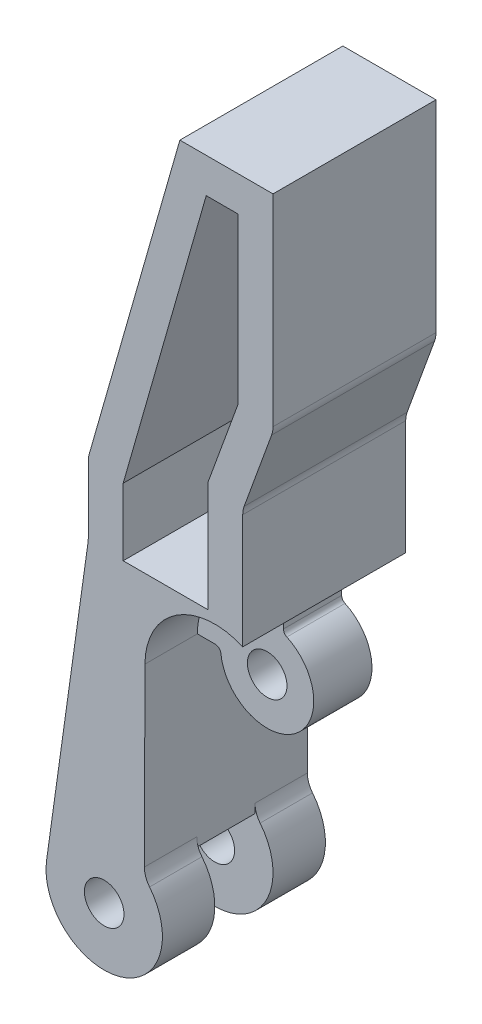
from build123d import *

# Parameters (mm, degrees)
BOSS_EXTRUDE1_DEPTH                                  = 7
CUT_EXTRUDE1_DEPTH                                   = 64.294944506
CUT_EXTRUDE1_DEPTH_BACK                              = 64.294944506
BOSS_EXTRUDE2_DEPTH                                  = 2.5
SKETCH4_R                                            = 5
CUT_EXTRUDE2_DEPTH                                   = 2.5
M3_CLEARANCE_HOLE1_D                                 = 3.4
CSK_FOR_M3_HEX_SOCKET_COUNTERSUNK_CAP_SC_D           = 3.4
CSK_FOR_M3_HEX_SOCKET_COUNTERSUNK_CAP_SC_DEPTH       = 14.000055
CSK_FOR_M3_HEX_SOCKET_COUNTERSUNK_CAP_SC_CSINK_D     = 6.72
CSK_FOR_M3_HEX_SOCKET_COUNTERSUNK_CAP_SC_CSINK_ANGLE = 90
FILLET1_R                                            = 2


with BuildPart() as part:
    # Sketch1 → Boss-Extrude1 (new, symmetric)
    with BuildSketch(Plane.XY):
        with BuildLine():
            Line((14.5, 60), (6.5, 60))
            Line((6.5, 60), (-1.369998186, 32.461736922))
            Line((-1.369998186, 32.461736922), (-1.369998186, 26.270646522))
            Line((-1.369998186, 26.270646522), (-4.95168551, 0.693405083))
            ThreePointArc((-4.95168551, 0.693405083), (1.64484588, -4.721703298), (3.449110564, 3.619894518))
            Line((3.449110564, 3.619894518), (3.500030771, 19.519215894))
            ThreePointArc((3.500030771, 19.519215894), (6.220755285, 24.524594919), (11.897915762, 25))
            Line((11.897915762, 25), (11.897915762, 35.181091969))
            Line((11.897915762, 35.181091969), (14.5, 42.325463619))
            Line((14.5, 42.325463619), (14.5, 60))
        make_face()
    extrude(amount=BOSS_EXTRUDE1_DEPTH, both=True)

    # Sketch2 → Cut-Extrude1 (cut, two sides: drawn at the far end of the back side and taken through both)
    with BuildSketch(Plane.XY.offset(7).offset(-CUT_EXTRUDE1_DEPTH_BACK)):
        Polygon((1.630001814, 26.270646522), (8.897915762, 26.270646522), (8.897915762, 35.710406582), (11.5, 42.854778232), (11.5, 57), (8.762752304, 57), (1.630001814, 32.041473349), align=None)
    extrude(amount=CUT_EXTRUDE1_DEPTH + CUT_EXTRUDE1_DEPTH_BACK, mode=Mode.SUBTRACT)

    # Sketch3 → Boss-Extrude2 (add, symmetric)
    with BuildSketch(Plane.XY):
        with BuildLine():
            Line((3.500030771, 19.519215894), (5.025757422, 19.519215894))
            ThreePointArc((5.025757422, 19.519215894), (5.359890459, 19.391177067), (5.522895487, 19.07263635))
            ThreePointArc((5.522895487, 19.07263635), (11.828138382, 16.247343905), (11.187036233, 23.126831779))
            ThreePointArc((11.187036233, 23.126831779), (10.976347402, 23.311336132), (10.897915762, 23.580185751))
            Line((10.897915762, 23.580185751), (10.897915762, 25.334880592))
            ThreePointArc((10.897915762, 25.334880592), (5.791872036, 24.216967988), (3.500030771, 19.519215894))
        make_face()
    extrude(amount=BOSS_EXTRUDE2_DEPTH, both=True)

    # Sketch4 → Cut-Extrude2 (cut, symmetric)
    with BuildSketch(Plane.XY):
        Circle(SKETCH4_R)
    extrude(amount=CUT_EXTRUDE2_DEPTH, both=True, mode=Mode.SUBTRACT)

    # M3 Clearance Hole1 (through all)
    with Locations(Plane.XY.offset(7)):
        with Locations((9.5, 19.5), (0, 0)):
            Hole(M3_CLEARANCE_HOLE1_D / 2)

    # CSK for M3 Hex Socket Countersunk Cap Sc
    with Locations(Plane(origin=(0, 0, -7), x_dir=(1, 0, 0), z_dir=(0, 0, -1))):
        with Locations((0, 0)):
            CounterSinkHole(CSK_FOR_M3_HEX_SOCKET_COUNTERSUNK_CAP_SC_D / 2, CSK_FOR_M3_HEX_SOCKET_COUNTERSUNK_CAP_SC_CSINK_D / 2, depth=CSK_FOR_M3_HEX_SOCKET_COUNTERSUNK_CAP_SC_DEPTH, counter_sink_angle=CSK_FOR_M3_HEX_SOCKET_COUNTERSUNK_CAP_SC_CSINK_ANGLE)

    # Fillet1
    fillet1_edges = [part.edges().sort_by_distance(p)[0] for p in [
        (3.449110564, 3.619894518, 4.75),
        (-1.369998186, 26.270646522, 0),
        (-1.369998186, 32.461736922, 0),
        (14.5, 42.325463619, 0),
        (11.897915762, 35.181091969, 0),
        (3.449110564, 3.619894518, -4.75),
    ]]
    fillet(fillet1_edges, radius=FILLET1_R)


solid = part.part
